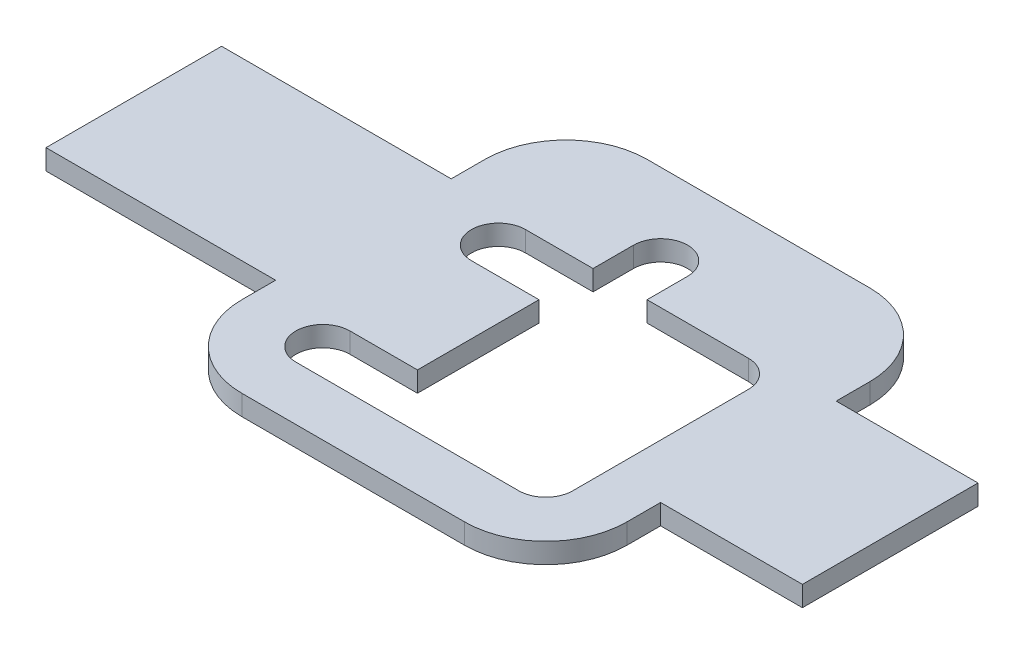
from build123d import *

# Parameters (mm, degrees)
EXTRUDE1_DEPTH = 3


with BuildPart() as part:
    # Sketch1 → Extrude1 (new body)
    with BuildSketch(Plane(origin=(0, 0, 0), x_dir=(1, 0, 0), z_dir=(0, 1, 0))):
        with BuildLine():
            Line((0, 0), (34, 0))
            Line((34, 0), (34, -5))
            ThreePointArc((34, -5), (37.514718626, -13.485281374), (46, -17))
            Line((46, -17), (79, -17))
            ThreePointArc((79, -17), (87.485281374, -13.485281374), (91, -5))
            Line((91, -5), (91, 0))
            Line((91, 0), (112, 0))
            Line((112, 0), (112, 26))
            Line((112, 26), (91, 26))
            Line((91, 26), (91, 31))
            ThreePointArc((91, 31), (87.485281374, 39.485281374), (79, 43))
            Line((79, 43), (46, 43))
            ThreePointArc((46, 43), (37.514718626, 39.485281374), (34, 31))
            Line((34, 31), (34, 26))
            Line((34, 26), (0, 26))
            Line((0, 26), (0, 0))
        make_face()
        with BuildLine():
            Line((83, -5), (83, 21))
            ThreePointArc((83, 21), (81.828427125, 23.828427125), (79, 25))
            Line((79, 25), (64, 25))
            Line((64, 25), (64, 31))
            ThreePointArc((64, 31), (60, 35), (56, 31))
            Line((56, 31), (56, 25))
            Line((56, 25), (46, 25))
            ThreePointArc((46, 25), (42, 21), (46, 17))
            Line((46, 17), (56, 17))
            Line((56, 17), (56, -1))
            Line((56, -1), (46, -1))
            ThreePointArc((46, -1), (42, -5), (46, -9))
            Line((46, -9), (79, -9))
            ThreePointArc((79, -9), (81.828427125, -7.828427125), (83, -5))
        make_face(mode=Mode.SUBTRACT)
    extrude(amount=EXTRUDE1_DEPTH)


solid = part.part
